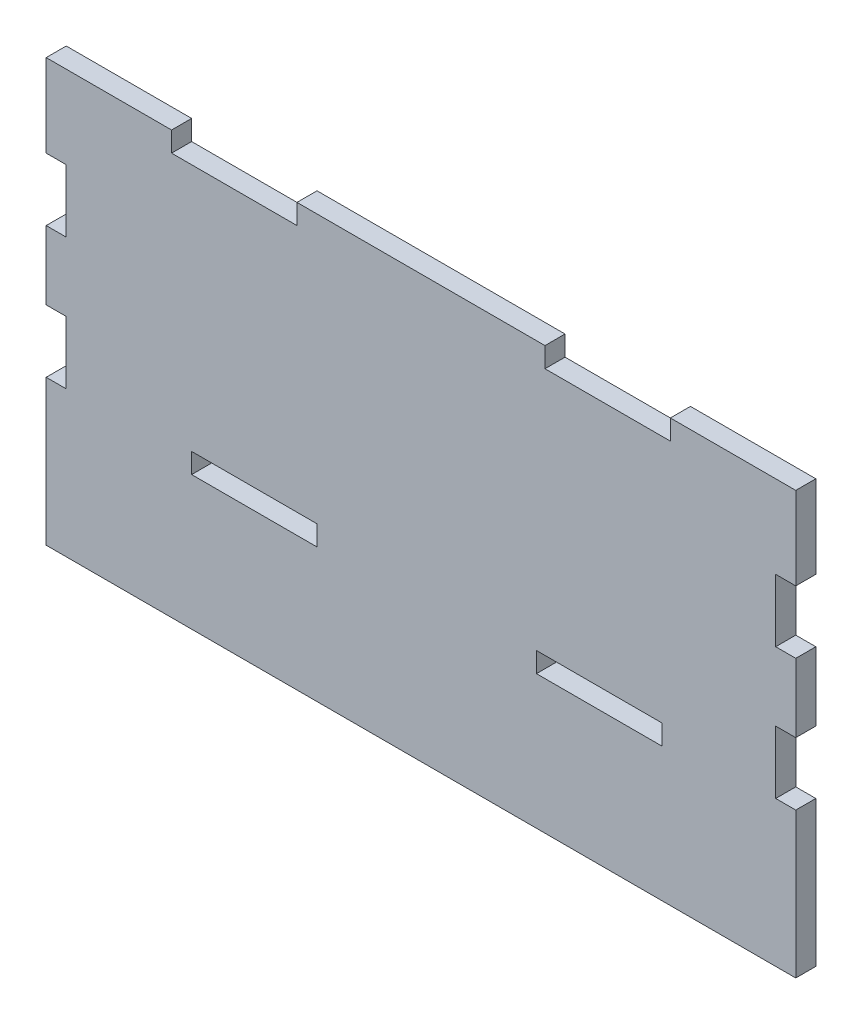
ISO-10303-21;
HEADER;
FILE_DESCRIPTION(('STEP AP214'),'2;1');
FILE_NAME('part.step','',(''),(''),'','','');
FILE_SCHEMA(('AUTOMOTIVE_DESIGN { 1 0 10303 214 1 1 1 1 }'));
ENDSEC;
DATA;
#1=APPLICATION_CONTEXT('core data for automotive mechanical design processes');
#2=APPLICATION_PROTOCOL_DEFINITION('international standard','automotive_design',2000,#1);
#3=PRODUCT_CONTEXT('',#1,'mechanical');
#4=PRODUCT('Part','Part','',(#3));
#5=PRODUCT_RELATED_PRODUCT_CATEGORY('part','',(#4));
#6=PRODUCT_DEFINITION_FORMATION('','',#4);
#7=PRODUCT_DEFINITION_CONTEXT('part definition',#1,'design');
#8=PRODUCT_DEFINITION('design','',#6,#7);
#9=PRODUCT_DEFINITION_SHAPE('','',#8);
#10=(LENGTH_UNIT() NAMED_UNIT(*) SI_UNIT(.MILLI.,.METRE.));
#11=(NAMED_UNIT(*) PLANE_ANGLE_UNIT() SI_UNIT($,.RADIAN.));
#12=(NAMED_UNIT(*) SI_UNIT($,.STERADIAN.) SOLID_ANGLE_UNIT());
#13=UNCERTAINTY_MEASURE_WITH_UNIT(LENGTH_MEASURE(1.E-05),#10,'distance_accuracy_value','');
#14=(GEOMETRIC_REPRESENTATION_CONTEXT(3) GLOBAL_UNCERTAINTY_ASSIGNED_CONTEXT((#13)) GLOBAL_UNIT_ASSIGNED_CONTEXT((#10,
#11,#12)) REPRESENTATION_CONTEXT('',''));
#15=CARTESIAN_POINT('',(0.,0.,0.));
#16=DIRECTION('',(0.,0.,1.));
#17=DIRECTION('',(1.,0.,0.));
#18=AXIS2_PLACEMENT_3D('',#15,#16,#17);
#19=CARTESIAN_POINT('',(0.,90.8,16.));
#20=DIRECTION('',(0.,-1.,0.));
#21=DIRECTION('',(1.,0.,0.));
#22=AXIS2_PLACEMENT_3D('',#19,#20,#21);
#23=PLANE('',#22);
#24=DIRECTION('',(-1.,0.,0.));
#25=VECTOR('',#24,1.);
#26=CARTESIAN_POINT('',(0.,90.8,0.));
#27=LINE('',#26,#25);
#28=CARTESIAN_POINT('',(475.,90.8,0.));
#29=VERTEX_POINT('',#28);
#30=CARTESIAN_POINT('',(375.,90.8,0.));
#31=VERTEX_POINT('',#30);
#32=EDGE_CURVE('E392',#29,#31,#27,.T.);
#33=ORIENTED_EDGE('',*,*,#32,.T.);
#34=DIRECTION('',(0.,0.,-1.));
#35=VECTOR('',#34,1.);
#36=CARTESIAN_POINT('',(375.,90.8,16.));
#37=LINE('',#36,#35);
#38=CARTESIAN_POINT('',(375.,90.8,16.));
#39=VERTEX_POINT('',#38);
#40=EDGE_CURVE('E11',#39,#31,#37,.T.);
#41=ORIENTED_EDGE('',*,*,#40,.F.);
#42=DIRECTION('',(-1.,0.,0.));
#43=VECTOR('',#42,1.);
#44=CARTESIAN_POINT('',(0.,90.8,16.));
#45=LINE('',#44,#43);
#46=CARTESIAN_POINT('',(475.,90.8,16.));
#47=VERTEX_POINT('',#46);
#48=EDGE_CURVE('E282',#47,#39,#45,.T.);
#49=ORIENTED_EDGE('',*,*,#48,.F.);
#50=DIRECTION('',(0.,0.,-1.));
#51=VECTOR('',#50,1.);
#52=CARTESIAN_POINT('',(475.,90.8,16.));
#53=LINE('',#52,#51);
#54=EDGE_CURVE('E54',#47,#29,#53,.T.);
#55=ORIENTED_EDGE('',*,*,#54,.T.);
#56=EDGE_LOOP('',(#33,#41,#49,#55));
#57=FACE_BOUND('',#56,.T.);
#58=ADVANCED_FACE('F35',(#57),#23,.F.);
#59=CARTESIAN_POINT('',(375.,0.,16.));
#60=DIRECTION('',(-1.,0.,0.));
#61=DIRECTION('',(0.,0.,1.));
#62=AXIS2_PLACEMENT_3D('',#59,#60,#61);
#63=PLANE('',#62);
#64=DIRECTION('',(0.,1.,0.));
#65=VECTOR('',#64,1.);
#66=CARTESIAN_POINT('',(375.,0.,0.));
#67=LINE('',#66,#65);
#68=CARTESIAN_POINT('',(375.,106.8,0.));
#69=VERTEX_POINT('',#68);
#70=EDGE_CURVE('E288',#31,#69,#67,.T.);
#71=ORIENTED_EDGE('',*,*,#70,.T.);
#72=DIRECTION('',(0.,0.,-1.));
#73=VECTOR('',#72,1.);
#74=CARTESIAN_POINT('',(375.,106.8,16.));
#75=LINE('',#74,#73);
#76=CARTESIAN_POINT('',(375.,106.8,16.));
#77=VERTEX_POINT('',#76);
#78=EDGE_CURVE('E45',#77,#69,#75,.T.);
#79=ORIENTED_EDGE('',*,*,#78,.F.);
#80=DIRECTION('',(0.,1.,0.));
#81=VECTOR('',#80,1.);
#82=CARTESIAN_POINT('',(375.,0.,16.));
#83=LINE('',#82,#81);
#84=EDGE_CURVE('E276',#39,#77,#83,.T.);
#85=ORIENTED_EDGE('',*,*,#84,.F.);
#86=ORIENTED_EDGE('',*,*,#40,.T.);
#87=EDGE_LOOP('',(#71,#79,#85,#86));
#88=FACE_BOUND('',#87,.T.);
#89=ADVANCED_FACE('F287',(#88),#63,.F.);
#90=CARTESIAN_POINT('',(0.,106.8,16.));
#91=DIRECTION('',(0.,-1.,0.));
#92=DIRECTION('',(0.,0.,-1.));
#93=AXIS2_PLACEMENT_3D('',#90,#91,#92);
#94=PLANE('',#93);
#95=DIRECTION('',(-1.,0.,0.));
#96=VECTOR('',#95,1.);
#97=CARTESIAN_POINT('',(0.,106.8,0.));
#98=LINE('',#97,#96);
#99=CARTESIAN_POINT('',(475.,106.8,0.));
#100=VERTEX_POINT('',#99);
#101=EDGE_CURVE('E395',#100,#69,#98,.T.);
#102=ORIENTED_EDGE('',*,*,#101,.F.);
#103=DIRECTION('',(0.,0.,-1.));
#104=VECTOR('',#103,1.);
#105=CARTESIAN_POINT('',(475.,106.8,16.));
#106=LINE('',#105,#104);
#107=CARTESIAN_POINT('',(475.,106.8,16.));
#108=VERTEX_POINT('',#107);
#109=EDGE_CURVE('E164',#108,#100,#106,.T.);
#110=ORIENTED_EDGE('',*,*,#109,.F.);
#111=DIRECTION('',(-1.,0.,0.));
#112=VECTOR('',#111,1.);
#113=CARTESIAN_POINT('',(0.,106.8,16.));
#114=LINE('',#113,#112);
#115=EDGE_CURVE('E281',#108,#77,#114,.T.);
#116=ORIENTED_EDGE('',*,*,#115,.T.);
#117=ORIENTED_EDGE('',*,*,#78,.T.);
#118=EDGE_LOOP('',(#102,#110,#116,#117));
#119=FACE_BOUND('',#118,.T.);
#120=ADVANCED_FACE('F292',(#119),#94,.T.);
#121=CARTESIAN_POINT('',(581.8,0.,16.));
#122=DIRECTION('',(1.,0.,0.));
#123=DIRECTION('',(0.,0.,-1.));
#124=AXIS2_PLACEMENT_3D('',#121,#122,#123);
#125=PLANE('',#124);
#126=DIRECTION('',(0.,-1.,0.));
#127=VECTOR('',#126,1.);
#128=CARTESIAN_POINT('',(581.8,0.,0.));
#129=LINE('',#128,#127);
#130=CARTESIAN_POINT('',(581.8,320.8,0.));
#131=VERTEX_POINT('',#130);
#132=CARTESIAN_POINT('',(581.8,254.8,0.));
#133=VERTEX_POINT('',#132);
#134=EDGE_CURVE('E310',#131,#133,#129,.T.);
#135=ORIENTED_EDGE('',*,*,#134,.F.);
#136=DIRECTION('',(0.,0.,-1.));
#137=VECTOR('',#136,1.);
#138=CARTESIAN_POINT('',(581.8,320.8,16.));
#139=LINE('',#138,#137);
#140=CARTESIAN_POINT('',(581.8,320.8,16.));
#141=VERTEX_POINT('',#140);
#142=EDGE_CURVE('E402',#141,#131,#139,.T.);
#143=ORIENTED_EDGE('',*,*,#142,.F.);
#144=DIRECTION('',(0.,-1.,0.));
#145=VECTOR('',#144,1.);
#146=CARTESIAN_POINT('',(581.8,0.,16.));
#147=LINE('',#146,#145);
#148=CARTESIAN_POINT('',(581.8,254.8,16.));
#149=VERTEX_POINT('',#148);
#150=EDGE_CURVE('E800',#141,#149,#147,.T.);
#151=ORIENTED_EDGE('',*,*,#150,.T.);
#152=DIRECTION('',(0.,0.,-1.));
#153=VECTOR('',#152,1.);
#154=CARTESIAN_POINT('',(581.8,254.8,16.));
#155=LINE('',#154,#153);
#156=EDGE_CURVE('E404',#149,#133,#155,.T.);
#157=ORIENTED_EDGE('',*,*,#156,.T.);
#158=EDGE_LOOP('',(#135,#143,#151,#157));
#159=FACE_BOUND('',#158,.T.);
#160=ADVANCED_FACE('F610',(#159),#125,.T.);
#161=CARTESIAN_POINT('',(0.,320.8,16.));
#162=DIRECTION('',(0.,1.,0.));
#163=DIRECTION('',(0.,0.,1.));
#164=AXIS2_PLACEMENT_3D('',#161,#162,#163);
#165=PLANE('',#164);
#166=DIRECTION('',(1.,0.,0.));
#167=VECTOR('',#166,1.);
#168=CARTESIAN_POINT('',(0.,320.8,0.));
#169=LINE('',#168,#167);
#170=CARTESIAN_POINT('',(481.8,320.8,0.));
#171=VERTEX_POINT('',#170);
#172=EDGE_CURVE('E313',#171,#131,#169,.T.);
#173=ORIENTED_EDGE('',*,*,#172,.F.);
#174=DIRECTION('',(0.,0.,-1.));
#175=VECTOR('',#174,1.);
#176=CARTESIAN_POINT('',(481.8,320.8,16.));
#177=LINE('',#176,#175);
#178=CARTESIAN_POINT('',(481.8,320.8,16.));
#179=VERTEX_POINT('',#178);
#180=EDGE_CURVE('E464',#179,#171,#177,.T.);
#181=ORIENTED_EDGE('',*,*,#180,.F.);
#182=DIRECTION('',(1.,0.,0.));
#183=VECTOR('',#182,1.);
#184=CARTESIAN_POINT('',(0.,320.8,16.));
#185=LINE('',#184,#183);
#186=EDGE_CURVE('E795',#179,#141,#185,.T.);
#187=ORIENTED_EDGE('',*,*,#186,.T.);
#188=ORIENTED_EDGE('',*,*,#142,.T.);
#189=EDGE_LOOP('',(#173,#181,#187,#188));
#190=FACE_BOUND('',#189,.T.);
#191=ADVANCED_FACE('F598',(#190),#165,.T.);
#192=CARTESIAN_POINT('',(481.8,0.,16.));
#193=DIRECTION('',(1.,0.,0.));
#194=DIRECTION('',(0.,0.,-1.));
#195=AXIS2_PLACEMENT_3D('',#192,#193,#194);
#196=PLANE('',#195);
#197=DIRECTION('',(0.,-1.,0.));
#198=VECTOR('',#197,1.);
#199=CARTESIAN_POINT('',(481.8,0.,0.));
#200=LINE('',#199,#198);
#201=CARTESIAN_POINT('',(481.8,304.8,0.));
#202=VERTEX_POINT('',#201);
#203=EDGE_CURVE('E316',#171,#202,#200,.T.);
#204=ORIENTED_EDGE('',*,*,#203,.T.);
#205=DIRECTION('',(0.,0.,-1.));
#206=VECTOR('',#205,1.);
#207=CARTESIAN_POINT('',(481.8,304.8,16.));
#208=LINE('',#207,#206);
#209=CARTESIAN_POINT('',(481.8,304.8,16.));
#210=VERTEX_POINT('',#209);
#211=EDGE_CURVE('E461',#210,#202,#208,.T.);
#212=ORIENTED_EDGE('',*,*,#211,.F.);
#213=DIRECTION('',(0.,-1.,0.));
#214=VECTOR('',#213,1.);
#215=CARTESIAN_POINT('',(481.8,0.,16.));
#216=LINE('',#215,#214);
#217=EDGE_CURVE('E791',#179,#210,#216,.T.);
#218=ORIENTED_EDGE('',*,*,#217,.F.);
#219=ORIENTED_EDGE('',*,*,#180,.T.);
#220=EDGE_LOOP('',(#204,#212,#218,#219));
#221=FACE_BOUND('',#220,.T.);
#222=ADVANCED_FACE('F605',(#221),#196,.F.);
#223=CARTESIAN_POINT('',(0.,304.8,16.));
#224=DIRECTION('',(0.,-1.,0.));
#225=DIRECTION('',(0.,0.,-1.));
#226=AXIS2_PLACEMENT_3D('',#223,#224,#225);
#227=PLANE('',#226);
#228=DIRECTION('',(-1.,0.,0.));
#229=VECTOR('',#228,1.);
#230=CARTESIAN_POINT('',(0.,304.8,0.));
#231=LINE('',#230,#229);
#232=CARTESIAN_POINT('',(381.8,304.8,0.));
#233=VERTEX_POINT('',#232);
#234=EDGE_CURVE('E320',#202,#233,#231,.T.);
#235=ORIENTED_EDGE('',*,*,#234,.T.);
#236=DIRECTION('',(0.,0.,-1.));
#237=VECTOR('',#236,1.);
#238=CARTESIAN_POINT('',(381.8,304.8,16.));
#239=LINE('',#238,#237);
#240=CARTESIAN_POINT('',(381.8,304.8,16.));
#241=VERTEX_POINT('',#240);
#242=EDGE_CURVE('E459',#241,#233,#239,.T.);
#243=ORIENTED_EDGE('',*,*,#242,.F.);
#244=DIRECTION('',(-1.,0.,0.));
#245=VECTOR('',#244,1.);
#246=CARTESIAN_POINT('',(0.,304.8,16.));
#247=LINE('',#246,#245);
#248=EDGE_CURVE('E794',#210,#241,#247,.T.);
#249=ORIENTED_EDGE('',*,*,#248,.F.);
#250=ORIENTED_EDGE('',*,*,#211,.T.);
#251=EDGE_LOOP('',(#235,#243,#249,#250));
#252=FACE_BOUND('',#251,.T.);
#253=ADVANCED_FACE('F601',(#252),#227,.F.);
#254=CARTESIAN_POINT('',(381.8,0.,16.));
#255=DIRECTION('',(1.,0.,0.));
#256=DIRECTION('',(0.,0.,-1.));
#257=AXIS2_PLACEMENT_3D('',#254,#255,#256);
#258=PLANE('',#257);
#259=DIRECTION('',(0.,-1.,0.));
#260=VECTOR('',#259,1.);
#261=CARTESIAN_POINT('',(381.8,0.,0.));
#262=LINE('',#261,#260);
#263=CARTESIAN_POINT('',(381.8,320.8,0.));
#264=VERTEX_POINT('',#263);
#265=EDGE_CURVE('E323',#264,#233,#262,.T.);
#266=ORIENTED_EDGE('',*,*,#265,.F.);
#267=DIRECTION('',(0.,0.,-1.));
#268=VECTOR('',#267,1.);
#269=CARTESIAN_POINT('',(381.8,320.8,16.));
#270=LINE('',#269,#268);
#271=CARTESIAN_POINT('',(381.8,320.8,16.));
#272=VERTEX_POINT('',#271);
#273=EDGE_CURVE('E457',#272,#264,#270,.T.);
#274=ORIENTED_EDGE('',*,*,#273,.F.);
#275=DIRECTION('',(0.,-1.,0.));
#276=VECTOR('',#275,1.);
#277=CARTESIAN_POINT('',(381.8,0.,16.));
#278=LINE('',#277,#276);
#279=EDGE_CURVE('E806',#272,#241,#278,.T.);
#280=ORIENTED_EDGE('',*,*,#279,.T.);
#281=ORIENTED_EDGE('',*,*,#242,.T.);
#282=EDGE_LOOP('',(#266,#274,#280,#281));
#283=FACE_BOUND('',#282,.T.);
#284=ADVANCED_FACE('F596',(#283),#258,.T.);
#285=CARTESIAN_POINT('',(184.,320.8,0.));
#286=VERTEX_POINT('',#285);
#287=EDGE_CURVE('E317',#286,#264,#169,.T.);
#288=ORIENTED_EDGE('',*,*,#287,.F.);
#289=DIRECTION('',(0.,0.,-1.));
#290=VECTOR('',#289,1.);
#291=CARTESIAN_POINT('',(184.,320.8,16.));
#292=LINE('',#291,#290);
#293=CARTESIAN_POINT('',(184.,320.8,16.));
#294=VERTEX_POINT('',#293);
#295=EDGE_CURVE('E455',#294,#286,#292,.T.);
#296=ORIENTED_EDGE('',*,*,#295,.F.);
#297=EDGE_CURVE('E802',#294,#272,#185,.T.);
#298=ORIENTED_EDGE('',*,*,#297,.T.);
#299=ORIENTED_EDGE('',*,*,#273,.T.);
#300=EDGE_LOOP('',(#288,#296,#298,#299));
#301=FACE_BOUND('',#300,.T.);
#302=ADVANCED_FACE('F592',(#301),#165,.T.);
#303=CARTESIAN_POINT('',(184.000000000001,6.66133814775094E-13,16.));
#304=DIRECTION('',(1.,0.,0.));
#305=DIRECTION('',(0.,1.,0.));
#306=AXIS2_PLACEMENT_3D('',#303,#304,#305);
#307=PLANE('',#306);
#308=DIRECTION('',(0.,-1.,0.));
#309=VECTOR('',#308,1.);
#310=CARTESIAN_POINT('',(184.000000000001,6.66133814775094E-13,0.));
#311=LINE('',#310,#309);
#312=CARTESIAN_POINT('',(184.,304.8,0.));
#313=VERTEX_POINT('',#312);
#314=EDGE_CURVE('E326',#286,#313,#311,.T.);
#315=ORIENTED_EDGE('',*,*,#314,.T.);
#316=DIRECTION('',(0.,0.,-1.));
#317=VECTOR('',#316,1.);
#318=CARTESIAN_POINT('',(184.,304.8,16.));
#319=LINE('',#318,#317);
#320=CARTESIAN_POINT('',(184.,304.8,16.));
#321=VERTEX_POINT('',#320);
#322=EDGE_CURVE('E453',#321,#313,#319,.T.);
#323=ORIENTED_EDGE('',*,*,#322,.F.);
#324=DIRECTION('',(0.,-1.,0.));
#325=VECTOR('',#324,1.);
#326=CARTESIAN_POINT('',(184.000000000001,6.66133814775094E-13,16.));
#327=LINE('',#326,#325);
#328=EDGE_CURVE('E805',#294,#321,#327,.T.);
#329=ORIENTED_EDGE('',*,*,#328,.F.);
#330=ORIENTED_EDGE('',*,*,#295,.T.);
#331=EDGE_LOOP('',(#315,#323,#329,#330));
#332=FACE_BOUND('',#331,.T.);
#333=ADVANCED_FACE('F588',(#332),#307,.F.);
#334=CARTESIAN_POINT('',(0.,304.8,16.));
#335=DIRECTION('',(0.,1.,0.));
#336=DIRECTION('',(0.,0.,1.));
#337=AXIS2_PLACEMENT_3D('',#334,#335,#336);
#338=PLANE('',#337);
#339=DIRECTION('',(1.,0.,0.));
#340=VECTOR('',#339,1.);
#341=CARTESIAN_POINT('',(0.,304.8,0.));
#342=LINE('',#341,#340);
#343=CARTESIAN_POINT('',(84.0000000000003,304.8,0.));
#344=VERTEX_POINT('',#343);
#345=EDGE_CURVE('E329',#344,#313,#342,.T.);
#346=ORIENTED_EDGE('',*,*,#345,.F.);
#347=DIRECTION('',(0.,0.,-1.));
#348=VECTOR('',#347,1.);
#349=CARTESIAN_POINT('',(84.0000000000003,304.8,16.));
#350=LINE('',#349,#348);
#351=CARTESIAN_POINT('',(84.0000000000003,304.8,16.));
#352=VERTEX_POINT('',#351);
#353=EDGE_CURVE('E451',#352,#344,#350,.T.);
#354=ORIENTED_EDGE('',*,*,#353,.F.);
#355=DIRECTION('',(1.,0.,0.));
#356=VECTOR('',#355,1.);
#357=CARTESIAN_POINT('',(0.,304.8,16.));
#358=LINE('',#357,#356);
#359=EDGE_CURVE('E808',#352,#321,#358,.T.);
#360=ORIENTED_EDGE('',*,*,#359,.T.);
#361=ORIENTED_EDGE('',*,*,#322,.T.);
#362=EDGE_LOOP('',(#346,#354,#360,#361));
#363=FACE_BOUND('',#362,.T.);
#364=ADVANCED_FACE('F584',(#363),#338,.T.);
#365=CARTESIAN_POINT('',(84.,0.,16.));
#366=DIRECTION('',(1.,0.,0.));
#367=DIRECTION('',(0.,1.,0.));
#368=AXIS2_PLACEMENT_3D('',#365,#366,#367);
#369=PLANE('',#368);
#370=DIRECTION('',(0.,-1.,0.));
#371=VECTOR('',#370,1.);
#372=CARTESIAN_POINT('',(84.,0.,0.));
#373=LINE('',#372,#371);
#374=CARTESIAN_POINT('',(84.0000000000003,320.8,0.));
#375=VERTEX_POINT('',#374);
#376=EDGE_CURVE('E332',#375,#344,#373,.T.);
#377=ORIENTED_EDGE('',*,*,#376,.F.);
#378=DIRECTION('',(0.,0.,-1.));
#379=VECTOR('',#378,1.);
#380=CARTESIAN_POINT('',(84.0000000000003,320.8,16.));
#381=LINE('',#380,#379);
#382=CARTESIAN_POINT('',(84.0000000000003,320.8,16.));
#383=VERTEX_POINT('',#382);
#384=EDGE_CURVE('E449',#383,#375,#381,.T.);
#385=ORIENTED_EDGE('',*,*,#384,.F.);
#386=DIRECTION('',(0.,-1.,0.));
#387=VECTOR('',#386,1.);
#388=CARTESIAN_POINT('',(84.,0.,16.));
#389=LINE('',#388,#387);
#390=EDGE_CURVE('E817',#383,#352,#389,.T.);
#391=ORIENTED_EDGE('',*,*,#390,.T.);
#392=ORIENTED_EDGE('',*,*,#353,.T.);
#393=EDGE_LOOP('',(#377,#385,#391,#392));
#394=FACE_BOUND('',#393,.T.);
#395=ADVANCED_FACE('F580',(#394),#369,.T.);
#396=CARTESIAN_POINT('',(0.,320.8,16.));
#397=DIRECTION('',(0.,-1.,0.));
#398=DIRECTION('',(0.,0.,-1.));
#399=AXIS2_PLACEMENT_3D('',#396,#397,#398);
#400=PLANE('',#399);
#401=DIRECTION('',(-1.,0.,0.));
#402=VECTOR('',#401,1.);
#403=CARTESIAN_POINT('',(0.,320.8,0.));
#404=LINE('',#403,#402);
#405=CARTESIAN_POINT('',(-16.,320.8,0.));
#406=VERTEX_POINT('',#405);
#407=EDGE_CURVE('E335',#375,#406,#404,.T.);
#408=ORIENTED_EDGE('',*,*,#407,.T.);
#409=DIRECTION('',(0.,0.,-1.));
#410=VECTOR('',#409,1.);
#411=CARTESIAN_POINT('',(-16.,320.8,16.));
#412=LINE('',#411,#410);
#413=CARTESIAN_POINT('',(-16.,320.8,16.));
#414=VERTEX_POINT('',#413);
#415=EDGE_CURVE('E446',#414,#406,#412,.T.);
#416=ORIENTED_EDGE('',*,*,#415,.F.);
#417=DIRECTION('',(-1.,0.,0.));
#418=VECTOR('',#417,1.);
#419=CARTESIAN_POINT('',(0.,320.8,16.));
#420=LINE('',#419,#418);
#421=EDGE_CURVE('E820',#383,#414,#420,.T.);
#422=ORIENTED_EDGE('',*,*,#421,.F.);
#423=ORIENTED_EDGE('',*,*,#384,.T.);
#424=EDGE_LOOP('',(#408,#416,#422,#423));
#425=FACE_BOUND('',#424,.T.);
#426=ADVANCED_FACE('F576',(#425),#400,.F.);
#427=CARTESIAN_POINT('',(-15.9999999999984,0.,16.));
#428=DIRECTION('',(1.,0.,0.));
#429=DIRECTION('',(0.,1.,0.));
#430=AXIS2_PLACEMENT_3D('',#427,#428,#429);
#431=PLANE('',#430);
#432=DIRECTION('',(0.,-1.,0.));
#433=VECTOR('',#432,1.);
#434=CARTESIAN_POINT('',(-15.9999999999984,0.,0.));
#435=LINE('',#434,#433);
#436=CARTESIAN_POINT('',(-15.9999999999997,254.8,0.));
#437=VERTEX_POINT('',#436);
#438=EDGE_CURVE('E338',#406,#437,#435,.T.);
#439=ORIENTED_EDGE('',*,*,#438,.T.);
#440=DIRECTION('',(0.,0.,-1.));
#441=VECTOR('',#440,1.);
#442=CARTESIAN_POINT('',(-15.9999999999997,254.8,16.));
#443=LINE('',#442,#441);
#444=CARTESIAN_POINT('',(-15.9999999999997,254.8,16.));
#445=VERTEX_POINT('',#444);
#446=EDGE_CURVE('E443',#445,#437,#443,.T.);
#447=ORIENTED_EDGE('',*,*,#446,.F.);
#448=DIRECTION('',(0.,-1.,0.));
#449=VECTOR('',#448,1.);
#450=CARTESIAN_POINT('',(-15.9999999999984,0.,16.));
#451=LINE('',#450,#449);
#452=EDGE_CURVE('E823',#414,#445,#451,.T.);
#453=ORIENTED_EDGE('',*,*,#452,.F.);
#454=ORIENTED_EDGE('',*,*,#415,.T.);
#455=EDGE_LOOP('',(#439,#447,#453,#454));
#456=FACE_BOUND('',#455,.T.);
#457=ADVANCED_FACE('F572',(#456),#431,.F.);
#458=CARTESIAN_POINT('',(0.,254.8,16.));
#459=DIRECTION('',(0.,1.,0.));
#460=DIRECTION('',(0.,0.,1.));
#461=AXIS2_PLACEMENT_3D('',#458,#459,#460);
#462=PLANE('',#461);
#463=DIRECTION('',(1.,0.,0.));
#464=VECTOR('',#463,1.);
#465=CARTESIAN_POINT('',(0.,254.8,0.));
#466=LINE('',#465,#464);
#467=CARTESIAN_POINT('',(4.44089209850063E-13,254.8,0.));
#468=VERTEX_POINT('',#467);
#469=EDGE_CURVE('E341',#437,#468,#466,.T.);
#470=ORIENTED_EDGE('',*,*,#469,.T.);
#471=DIRECTION('',(0.,0.,-1.));
#472=VECTOR('',#471,1.);
#473=CARTESIAN_POINT('',(4.44089209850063E-13,254.8,16.));
#474=LINE('',#473,#472);
#475=CARTESIAN_POINT('',(4.44089209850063E-13,254.8,16.));
#476=VERTEX_POINT('',#475);
#477=EDGE_CURVE('E440',#476,#468,#474,.T.);
#478=ORIENTED_EDGE('',*,*,#477,.F.);
#479=DIRECTION('',(1.,0.,0.));
#480=VECTOR('',#479,1.);
#481=CARTESIAN_POINT('',(0.,254.8,16.));
#482=LINE('',#481,#480);
#483=EDGE_CURVE('E826',#445,#476,#482,.T.);
#484=ORIENTED_EDGE('',*,*,#483,.F.);
#485=ORIENTED_EDGE('',*,*,#446,.T.);
#486=EDGE_LOOP('',(#470,#478,#484,#485));
#487=FACE_BOUND('',#486,.T.);
#488=ADVANCED_FACE('F568',(#487),#462,.F.);
#489=CARTESIAN_POINT('',(4.44089209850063E-13,0.,16.));
#490=DIRECTION('',(1.,0.,0.));
#491=DIRECTION('',(0.,0.,-1.));
#492=AXIS2_PLACEMENT_3D('',#489,#490,#491);
#493=PLANE('',#492);
#494=DIRECTION('',(0.,-1.,0.));
#495=VECTOR('',#494,1.);
#496=CARTESIAN_POINT('',(4.44089209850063E-13,0.,0.));
#497=LINE('',#496,#495);
#498=CARTESIAN_POINT('',(4.44089209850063E-13,204.8,0.));
#499=VERTEX_POINT('',#498);
#500=EDGE_CURVE('E344',#468,#499,#497,.T.);
#501=ORIENTED_EDGE('',*,*,#500,.T.);
#502=DIRECTION('',(0.,0.,-1.));
#503=VECTOR('',#502,1.);
#504=CARTESIAN_POINT('',(4.44089209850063E-13,204.8,16.));
#505=LINE('',#504,#503);
#506=CARTESIAN_POINT('',(4.44089209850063E-13,204.8,16.));
#507=VERTEX_POINT('',#506);
#508=EDGE_CURVE('E438',#507,#499,#505,.T.);
#509=ORIENTED_EDGE('',*,*,#508,.F.);
#510=DIRECTION('',(0.,-1.,0.));
#511=VECTOR('',#510,1.);
#512=CARTESIAN_POINT('',(4.44089209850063E-13,0.,16.));
#513=LINE('',#512,#511);
#514=EDGE_CURVE('E829',#476,#507,#513,.T.);
#515=ORIENTED_EDGE('',*,*,#514,.F.);
#516=ORIENTED_EDGE('',*,*,#477,.T.);
#517=EDGE_LOOP('',(#501,#509,#515,#516));
#518=FACE_BOUND('',#517,.T.);
#519=ADVANCED_FACE('F564',(#518),#493,.F.);
#520=CARTESIAN_POINT('',(0.,204.8,16.));
#521=DIRECTION('',(0.,1.,0.));
#522=DIRECTION('',(0.,0.,1.));
#523=AXIS2_PLACEMENT_3D('',#520,#521,#522);
#524=PLANE('',#523);
#525=DIRECTION('',(1.,0.,0.));
#526=VECTOR('',#525,1.);
#527=CARTESIAN_POINT('',(0.,204.8,0.));
#528=LINE('',#527,#526);
#529=CARTESIAN_POINT('',(-15.9999999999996,204.8,0.));
#530=VERTEX_POINT('',#529);
#531=EDGE_CURVE('E347',#530,#499,#528,.T.);
#532=ORIENTED_EDGE('',*,*,#531,.F.);
#533=DIRECTION('',(0.,0.,-1.));
#534=VECTOR('',#533,1.);
#535=CARTESIAN_POINT('',(-15.9999999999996,204.8,16.));
#536=LINE('',#535,#534);
#537=CARTESIAN_POINT('',(-15.9999999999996,204.8,16.));
#538=VERTEX_POINT('',#537);
#539=EDGE_CURVE('E436',#538,#530,#536,.T.);
#540=ORIENTED_EDGE('',*,*,#539,.F.);
#541=DIRECTION('',(1.,0.,0.));
#542=VECTOR('',#541,1.);
#543=CARTESIAN_POINT('',(0.,204.8,16.));
#544=LINE('',#543,#542);
#545=EDGE_CURVE('E831',#538,#507,#544,.T.);
#546=ORIENTED_EDGE('',*,*,#545,.T.);
#547=ORIENTED_EDGE('',*,*,#508,.T.);
#548=EDGE_LOOP('',(#532,#540,#546,#547));
#549=FACE_BOUND('',#548,.T.);
#550=ADVANCED_FACE('F560',(#549),#524,.T.);
#551=CARTESIAN_POINT('',(-16.,0.,16.));
#552=DIRECTION('',(1.,0.,0.));
#553=DIRECTION('',(0.,1.,0.));
#554=AXIS2_PLACEMENT_3D('',#551,#552,#553);
#555=PLANE('',#554);
#556=DIRECTION('',(0.,-1.,0.));
#557=VECTOR('',#556,1.);
#558=CARTESIAN_POINT('',(-16.,0.,0.));
#559=LINE('',#558,#557);
#560=CARTESIAN_POINT('',(-15.9999999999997,150.,0.));
#561=VERTEX_POINT('',#560);
#562=EDGE_CURVE('E350',#530,#561,#559,.T.);
#563=ORIENTED_EDGE('',*,*,#562,.T.);
#564=DIRECTION('',(0.,0.,-1.));
#565=VECTOR('',#564,1.);
#566=CARTESIAN_POINT('',(-15.9999999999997,150.,16.));
#567=LINE('',#566,#565);
#568=CARTESIAN_POINT('',(-15.9999999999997,150.,16.));
#569=VERTEX_POINT('',#568);
#570=EDGE_CURVE('E433',#569,#561,#567,.T.);
#571=ORIENTED_EDGE('',*,*,#570,.F.);
#572=DIRECTION('',(0.,-1.,0.));
#573=VECTOR('',#572,1.);
#574=CARTESIAN_POINT('',(-16.,0.,16.));
#575=LINE('',#574,#573);
#576=EDGE_CURVE('E834',#538,#569,#575,.T.);
#577=ORIENTED_EDGE('',*,*,#576,.F.);
#578=ORIENTED_EDGE('',*,*,#539,.T.);
#579=EDGE_LOOP('',(#563,#571,#577,#578));
#580=FACE_BOUND('',#579,.T.);
#581=ADVANCED_FACE('F556',(#580),#555,.F.);
#582=CARTESIAN_POINT('',(0.,150.,16.));
#583=DIRECTION('',(0.,1.,0.));
#584=DIRECTION('',(0.,0.,1.));
#585=AXIS2_PLACEMENT_3D('',#582,#583,#584);
#586=PLANE('',#585);
#587=DIRECTION('',(1.,0.,0.));
#588=VECTOR('',#587,1.);
#589=CARTESIAN_POINT('',(0.,150.,0.));
#590=LINE('',#589,#588);
#591=CARTESIAN_POINT('',(3.33066907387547E-13,150.,0.));
#592=VERTEX_POINT('',#591);
#593=EDGE_CURVE('E353',#561,#592,#590,.T.);
#594=ORIENTED_EDGE('',*,*,#593,.T.);
#595=DIRECTION('',(0.,0.,-1.));
#596=VECTOR('',#595,1.);
#597=CARTESIAN_POINT('',(3.33066907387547E-13,150.,16.));
#598=LINE('',#597,#596);
#599=CARTESIAN_POINT('',(3.33066907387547E-13,150.,16.));
#600=VERTEX_POINT('',#599);
#601=EDGE_CURVE('E430',#600,#592,#598,.T.);
#602=ORIENTED_EDGE('',*,*,#601,.F.);
#603=DIRECTION('',(1.,0.,0.));
#604=VECTOR('',#603,1.);
#605=CARTESIAN_POINT('',(0.,150.,16.));
#606=LINE('',#605,#604);
#607=EDGE_CURVE('E837',#569,#600,#606,.T.);
#608=ORIENTED_EDGE('',*,*,#607,.F.);
#609=ORIENTED_EDGE('',*,*,#570,.T.);
#610=EDGE_LOOP('',(#594,#602,#608,#609));
#611=FACE_BOUND('',#610,.T.);
#612=ADVANCED_FACE('F552',(#611),#586,.F.);
#613=CARTESIAN_POINT('',(3.33066907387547E-13,0.,16.));
#614=DIRECTION('',(1.,0.,0.));
#615=DIRECTION('',(0.,0.,-1.));
#616=AXIS2_PLACEMENT_3D('',#613,#614,#615);
#617=PLANE('',#616);
#618=DIRECTION('',(0.,-1.,0.));
#619=VECTOR('',#618,1.);
#620=CARTESIAN_POINT('',(3.33066907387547E-13,0.,0.));
#621=LINE('',#620,#619);
#622=CARTESIAN_POINT('',(3.33066907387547E-13,99.9999999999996,0.));
#623=VERTEX_POINT('',#622);
#624=EDGE_CURVE('E356',#592,#623,#621,.T.);
#625=ORIENTED_EDGE('',*,*,#624,.T.);
#626=DIRECTION('',(0.,0.,-1.));
#627=VECTOR('',#626,1.);
#628=CARTESIAN_POINT('',(3.33066907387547E-13,99.9999999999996,16.));
#629=LINE('',#628,#627);
#630=CARTESIAN_POINT('',(3.33066907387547E-13,99.9999999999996,16.));
#631=VERTEX_POINT('',#630);
#632=EDGE_CURVE('E427',#631,#623,#629,.T.);
#633=ORIENTED_EDGE('',*,*,#632,.F.);
#634=DIRECTION('',(0.,-1.,0.));
#635=VECTOR('',#634,1.);
#636=CARTESIAN_POINT('',(3.33066907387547E-13,0.,16.));
#637=LINE('',#636,#635);
#638=EDGE_CURVE('E840',#600,#631,#637,.T.);
#639=ORIENTED_EDGE('',*,*,#638,.F.);
#640=ORIENTED_EDGE('',*,*,#601,.T.);
#641=EDGE_LOOP('',(#625,#633,#639,#640));
#642=FACE_BOUND('',#641,.T.);
#643=ADVANCED_FACE('F548',(#642),#617,.F.);
#644=CARTESIAN_POINT('',(0.,99.9999999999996,16.));
#645=DIRECTION('',(0.,-1.,0.));
#646=DIRECTION('',(0.,0.,-1.));
#647=AXIS2_PLACEMENT_3D('',#644,#645,#646);
#648=PLANE('',#647);
#649=DIRECTION('',(-1.,0.,0.));
#650=VECTOR('',#649,1.);
#651=CARTESIAN_POINT('',(0.,99.9999999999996,0.));
#652=LINE('',#651,#650);
#653=CARTESIAN_POINT('',(-15.9999999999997,99.9999999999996,0.));
#654=VERTEX_POINT('',#653);
#655=EDGE_CURVE('E359',#623,#654,#652,.T.);
#656=ORIENTED_EDGE('',*,*,#655,.T.);
#657=DIRECTION('',(0.,0.,-1.));
#658=VECTOR('',#657,1.);
#659=CARTESIAN_POINT('',(-15.9999999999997,99.9999999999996,16.));
#660=LINE('',#659,#658);
#661=CARTESIAN_POINT('',(-15.9999999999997,99.9999999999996,16.));
#662=VERTEX_POINT('',#661);
#663=EDGE_CURVE('E424',#662,#654,#660,.T.);
#664=ORIENTED_EDGE('',*,*,#663,.F.);
#665=DIRECTION('',(-1.,0.,0.));
#666=VECTOR('',#665,1.);
#667=CARTESIAN_POINT('',(0.,99.9999999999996,16.));
#668=LINE('',#667,#666);
#669=EDGE_CURVE('E843',#631,#662,#668,.T.);
#670=ORIENTED_EDGE('',*,*,#669,.F.);
#671=ORIENTED_EDGE('',*,*,#632,.T.);
#672=EDGE_LOOP('',(#656,#664,#670,#671));
#673=FACE_BOUND('',#672,.T.);
#674=ADVANCED_FACE('F544',(#673),#648,.F.);
#675=CARTESIAN_POINT('',(-16.,0.,16.));
#676=DIRECTION('',(1.,0.,0.));
#677=DIRECTION('',(0.,1.,0.));
#678=AXIS2_PLACEMENT_3D('',#675,#676,#677);
#679=PLANE('',#678);
#680=DIRECTION('',(0.,-1.,0.));
#681=VECTOR('',#680,1.);
#682=CARTESIAN_POINT('',(-16.,0.,0.));
#683=LINE('',#682,#681);
#684=CARTESIAN_POINT('',(-16.,-16.,0.));
#685=VERTEX_POINT('',#684);
#686=EDGE_CURVE('E362',#654,#685,#683,.T.);
#687=ORIENTED_EDGE('',*,*,#686,.T.);
#688=DIRECTION('',(0.,0.,-1.));
#689=VECTOR('',#688,1.);
#690=CARTESIAN_POINT('',(-16.,-16.,16.));
#691=LINE('',#690,#689);
#692=CARTESIAN_POINT('',(-16.,-16.,16.));
#693=VERTEX_POINT('',#692);
#694=EDGE_CURVE('E422',#693,#685,#691,.T.);
#695=ORIENTED_EDGE('',*,*,#694,.F.);
#696=DIRECTION('',(0.,-1.,0.));
#697=VECTOR('',#696,1.);
#698=CARTESIAN_POINT('',(-16.,0.,16.));
#699=LINE('',#698,#697);
#700=EDGE_CURVE('E846',#662,#693,#699,.T.);
#701=ORIENTED_EDGE('',*,*,#700,.F.);
#702=ORIENTED_EDGE('',*,*,#663,.T.);
#703=EDGE_LOOP('',(#687,#695,#701,#702));
#704=FACE_BOUND('',#703,.T.);
#705=ADVANCED_FACE('F540',(#704),#679,.F.);
#706=CARTESIAN_POINT('',(0.,-16.,16.));
#707=DIRECTION('',(0.,-1.,0.));
#708=DIRECTION('',(1.,0.,0.));
#709=AXIS2_PLACEMENT_3D('',#706,#707,#708);
#710=PLANE('',#709);
#711=DIRECTION('',(-1.,0.,0.));
#712=VECTOR('',#711,1.);
#713=CARTESIAN_POINT('',(0.,-16.,0.));
#714=LINE('',#713,#712);
#715=CARTESIAN_POINT('',(581.8,-16.,0.));
#716=VERTEX_POINT('',#715);
#717=EDGE_CURVE('E365',#716,#685,#714,.T.);
#718=ORIENTED_EDGE('',*,*,#717,.F.);
#719=DIRECTION('',(0.,0.,-1.));
#720=VECTOR('',#719,1.);
#721=CARTESIAN_POINT('',(581.8,-16.,16.));
#722=LINE('',#721,#720);
#723=CARTESIAN_POINT('',(581.8,-16.,16.));
#724=VERTEX_POINT('',#723);
#725=EDGE_CURVE('E420',#724,#716,#722,.T.);
#726=ORIENTED_EDGE('',*,*,#725,.F.);
#727=DIRECTION('',(-1.,0.,0.));
#728=VECTOR('',#727,1.);
#729=CARTESIAN_POINT('',(0.,-16.,16.));
#730=LINE('',#729,#728);
#731=EDGE_CURVE('E848',#724,#693,#730,.T.);
#732=ORIENTED_EDGE('',*,*,#731,.T.);
#733=ORIENTED_EDGE('',*,*,#694,.T.);
#734=EDGE_LOOP('',(#718,#726,#732,#733));
#735=FACE_BOUND('',#734,.T.);
#736=ADVANCED_FACE('F536',(#735),#710,.T.);
#737=CARTESIAN_POINT('',(581.8,0.,16.));
#738=DIRECTION('',(1.,0.,0.));
#739=DIRECTION('',(0.,0.,-1.));
#740=AXIS2_PLACEMENT_3D('',#737,#738,#739);
#741=PLANE('',#740);
#742=DIRECTION('',(0.,-1.,0.));
#743=VECTOR('',#742,1.);
#744=CARTESIAN_POINT('',(581.8,0.,0.));
#745=LINE('',#744,#743);
#746=CARTESIAN_POINT('',(581.8,99.9999999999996,0.));
#747=VERTEX_POINT('',#746);
#748=EDGE_CURVE('E368',#747,#716,#745,.T.);
#749=ORIENTED_EDGE('',*,*,#748,.F.);
#750=DIRECTION('',(0.,0.,-1.));
#751=VECTOR('',#750,1.);
#752=CARTESIAN_POINT('',(581.8,99.9999999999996,16.));
#753=LINE('',#752,#751);
#754=CARTESIAN_POINT('',(581.8,99.9999999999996,16.));
#755=VERTEX_POINT('',#754);
#756=EDGE_CURVE('E418',#755,#747,#753,.T.);
#757=ORIENTED_EDGE('',*,*,#756,.F.);
#758=DIRECTION('',(0.,-1.,0.));
#759=VECTOR('',#758,1.);
#760=CARTESIAN_POINT('',(581.8,0.,16.));
#761=LINE('',#760,#759);
#762=EDGE_CURVE('E851',#755,#724,#761,.T.);
#763=ORIENTED_EDGE('',*,*,#762,.T.);
#764=ORIENTED_EDGE('',*,*,#725,.T.);
#765=EDGE_LOOP('',(#749,#757,#763,#764));
#766=FACE_BOUND('',#765,.T.);
#767=ADVANCED_FACE('F532',(#766),#741,.T.);
#768=CARTESIAN_POINT('',(0.,99.9999999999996,16.));
#769=DIRECTION('',(0.,1.,0.));
#770=DIRECTION('',(0.,0.,1.));
#771=AXIS2_PLACEMENT_3D('',#768,#769,#770);
#772=PLANE('',#771);
#773=DIRECTION('',(1.,0.,0.));
#774=VECTOR('',#773,1.);
#775=CARTESIAN_POINT('',(0.,99.9999999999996,0.));
#776=LINE('',#775,#774);
#777=CARTESIAN_POINT('',(565.800000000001,99.9999999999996,0.));
#778=VERTEX_POINT('',#777);
#779=EDGE_CURVE('E371',#778,#747,#776,.T.);
#780=ORIENTED_EDGE('',*,*,#779,.F.);
#781=DIRECTION('',(0.,0.,-1.));
#782=VECTOR('',#781,1.);
#783=CARTESIAN_POINT('',(565.800000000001,99.9999999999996,16.));
#784=LINE('',#783,#782);
#785=CARTESIAN_POINT('',(565.800000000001,99.9999999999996,16.));
#786=VERTEX_POINT('',#785);
#787=EDGE_CURVE('E416',#786,#778,#784,.T.);
#788=ORIENTED_EDGE('',*,*,#787,.F.);
#789=DIRECTION('',(1.,0.,0.));
#790=VECTOR('',#789,1.);
#791=CARTESIAN_POINT('',(0.,99.9999999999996,16.));
#792=LINE('',#791,#790);
#793=EDGE_CURVE('E854',#786,#755,#792,.T.);
#794=ORIENTED_EDGE('',*,*,#793,.T.);
#795=ORIENTED_EDGE('',*,*,#756,.T.);
#796=EDGE_LOOP('',(#780,#788,#794,#795));
#797=FACE_BOUND('',#796,.T.);
#798=ADVANCED_FACE('F528',(#797),#772,.T.);
#799=CARTESIAN_POINT('',(565.800000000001,0.,16.));
#800=DIRECTION('',(1.,0.,0.));
#801=DIRECTION('',(0.,0.,-1.));
#802=AXIS2_PLACEMENT_3D('',#799,#800,#801);
#803=PLANE('',#802);
#804=DIRECTION('',(0.,-1.,0.));
#805=VECTOR('',#804,1.);
#806=CARTESIAN_POINT('',(565.800000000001,0.,0.));
#807=LINE('',#806,#805);
#808=CARTESIAN_POINT('',(565.800000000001,150.,0.));
#809=VERTEX_POINT('',#808);
#810=EDGE_CURVE('E374',#809,#778,#807,.T.);
#811=ORIENTED_EDGE('',*,*,#810,.F.);
#812=DIRECTION('',(0.,0.,-1.));
#813=VECTOR('',#812,1.);
#814=CARTESIAN_POINT('',(565.800000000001,150.,16.));
#815=LINE('',#814,#813);
#816=CARTESIAN_POINT('',(565.800000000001,150.,16.));
#817=VERTEX_POINT('',#816);
#818=EDGE_CURVE('E414',#817,#809,#815,.T.);
#819=ORIENTED_EDGE('',*,*,#818,.F.);
#820=DIRECTION('',(0.,-1.,0.));
#821=VECTOR('',#820,1.);
#822=CARTESIAN_POINT('',(565.800000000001,0.,16.));
#823=LINE('',#822,#821);
#824=EDGE_CURVE('E857',#817,#786,#823,.T.);
#825=ORIENTED_EDGE('',*,*,#824,.T.);
#826=ORIENTED_EDGE('',*,*,#787,.T.);
#827=EDGE_LOOP('',(#811,#819,#825,#826));
#828=FACE_BOUND('',#827,.T.);
#829=ADVANCED_FACE('F524',(#828),#803,.T.);
#830=CARTESIAN_POINT('',(0.,150.,16.));
#831=DIRECTION('',(0.,-1.,0.));
#832=DIRECTION('',(0.,0.,-1.));
#833=AXIS2_PLACEMENT_3D('',#830,#831,#832);
#834=PLANE('',#833);
#835=DIRECTION('',(-1.,0.,0.));
#836=VECTOR('',#835,1.);
#837=CARTESIAN_POINT('',(0.,150.,0.));
#838=LINE('',#837,#836);
#839=CARTESIAN_POINT('',(581.8,150.,0.));
#840=VERTEX_POINT('',#839);
#841=EDGE_CURVE('E377',#840,#809,#838,.T.);
#842=ORIENTED_EDGE('',*,*,#841,.F.);
#843=DIRECTION('',(0.,0.,-1.));
#844=VECTOR('',#843,1.);
#845=CARTESIAN_POINT('',(581.8,150.,16.));
#846=LINE('',#845,#844);
#847=CARTESIAN_POINT('',(581.8,150.,16.));
#848=VERTEX_POINT('',#847);
#849=EDGE_CURVE('E412',#848,#840,#846,.T.);
#850=ORIENTED_EDGE('',*,*,#849,.F.);
#851=DIRECTION('',(-1.,0.,0.));
#852=VECTOR('',#851,1.);
#853=CARTESIAN_POINT('',(0.,150.,16.));
#854=LINE('',#853,#852);
#855=EDGE_CURVE('E860',#848,#817,#854,.T.);
#856=ORIENTED_EDGE('',*,*,#855,.T.);
#857=ORIENTED_EDGE('',*,*,#818,.T.);
#858=EDGE_LOOP('',(#842,#850,#856,#857));
#859=FACE_BOUND('',#858,.T.);
#860=ADVANCED_FACE('F520',(#859),#834,.T.);
#861=CARTESIAN_POINT('',(581.8,0.,16.));
#862=DIRECTION('',(1.,0.,0.));
#863=DIRECTION('',(0.,0.,-1.));
#864=AXIS2_PLACEMENT_3D('',#861,#862,#863);
#865=PLANE('',#864);
#866=DIRECTION('',(0.,-1.,0.));
#867=VECTOR('',#866,1.);
#868=CARTESIAN_POINT('',(581.8,0.,0.));
#869=LINE('',#868,#867);
#870=CARTESIAN_POINT('',(581.8,204.8,0.));
#871=VERTEX_POINT('',#870);
#872=EDGE_CURVE('E380',#871,#840,#869,.T.);
#873=ORIENTED_EDGE('',*,*,#872,.F.);
#874=DIRECTION('',(0.,0.,-1.));
#875=VECTOR('',#874,1.);
#876=CARTESIAN_POINT('',(581.8,204.8,16.));
#877=LINE('',#876,#875);
#878=CARTESIAN_POINT('',(581.8,204.8,16.));
#879=VERTEX_POINT('',#878);
#880=EDGE_CURVE('E410',#879,#871,#877,.T.);
#881=ORIENTED_EDGE('',*,*,#880,.F.);
#882=DIRECTION('',(0.,-1.,0.));
#883=VECTOR('',#882,1.);
#884=CARTESIAN_POINT('',(581.8,0.,16.));
#885=LINE('',#884,#883);
#886=EDGE_CURVE('E863',#879,#848,#885,.T.);
#887=ORIENTED_EDGE('',*,*,#886,.T.);
#888=ORIENTED_EDGE('',*,*,#849,.T.);
#889=EDGE_LOOP('',(#873,#881,#887,#888));
#890=FACE_BOUND('',#889,.T.);
#891=ADVANCED_FACE('F516',(#890),#865,.T.);
#892=CARTESIAN_POINT('',(0.,204.8,16.));
#893=DIRECTION('',(0.,-1.,0.));
#894=DIRECTION('',(0.,0.,-1.));
#895=AXIS2_PLACEMENT_3D('',#892,#893,#894);
#896=PLANE('',#895);
#897=DIRECTION('',(-1.,0.,0.));
#898=VECTOR('',#897,1.);
#899=CARTESIAN_POINT('',(0.,204.8,0.));
#900=LINE('',#899,#898);
#901=CARTESIAN_POINT('',(565.800000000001,204.8,0.));
#902=VERTEX_POINT('',#901);
#903=EDGE_CURVE('E383',#871,#902,#900,.T.);
#904=ORIENTED_EDGE('',*,*,#903,.T.);
#905=DIRECTION('',(0.,0.,-1.));
#906=VECTOR('',#905,1.);
#907=CARTESIAN_POINT('',(565.800000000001,204.8,16.));
#908=LINE('',#907,#906);
#909=CARTESIAN_POINT('',(565.800000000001,204.8,16.));
#910=VERTEX_POINT('',#909);
#911=EDGE_CURVE('E408',#910,#902,#908,.T.);
#912=ORIENTED_EDGE('',*,*,#911,.F.);
#913=DIRECTION('',(-1.,0.,0.));
#914=VECTOR('',#913,1.);
#915=CARTESIAN_POINT('',(0.,204.8,16.));
#916=LINE('',#915,#914);
#917=EDGE_CURVE('E866',#879,#910,#916,.T.);
#918=ORIENTED_EDGE('',*,*,#917,.F.);
#919=ORIENTED_EDGE('',*,*,#880,.T.);
#920=EDGE_LOOP('',(#904,#912,#918,#919));
#921=FACE_BOUND('',#920,.T.);
#922=ADVANCED_FACE('F512',(#921),#896,.F.);
#923=CARTESIAN_POINT('',(565.800000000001,0.,16.));
#924=DIRECTION('',(1.,0.,0.));
#925=DIRECTION('',(0.,0.,-1.));
#926=AXIS2_PLACEMENT_3D('',#923,#924,#925);
#927=PLANE('',#926);
#928=DIRECTION('',(0.,-1.,0.));
#929=VECTOR('',#928,1.);
#930=CARTESIAN_POINT('',(565.800000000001,0.,0.));
#931=LINE('',#930,#929);
#932=CARTESIAN_POINT('',(565.800000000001,254.8,0.));
#933=VERTEX_POINT('',#932);
#934=EDGE_CURVE('E386',#933,#902,#931,.T.);
#935=ORIENTED_EDGE('',*,*,#934,.F.);
#936=DIRECTION('',(0.,0.,-1.));
#937=VECTOR('',#936,1.);
#938=CARTESIAN_POINT('',(565.800000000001,254.8,16.));
#939=LINE('',#938,#937);
#940=CARTESIAN_POINT('',(565.800000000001,254.8,16.));
#941=VERTEX_POINT('',#940);
#942=EDGE_CURVE('E406',#941,#933,#939,.T.);
#943=ORIENTED_EDGE('',*,*,#942,.F.);
#944=DIRECTION('',(0.,-1.,0.));
#945=VECTOR('',#944,1.);
#946=CARTESIAN_POINT('',(565.800000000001,0.,16.));
#947=LINE('',#946,#945);
#948=EDGE_CURVE('E868',#941,#910,#947,.T.);
#949=ORIENTED_EDGE('',*,*,#948,.T.);
#950=ORIENTED_EDGE('',*,*,#911,.T.);
#951=EDGE_LOOP('',(#935,#943,#949,#950));
#952=FACE_BOUND('',#951,.T.);
#953=ADVANCED_FACE('F509',(#952),#927,.T.);
#954=CARTESIAN_POINT('',(0.,90.7999999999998,16.));
#955=DIRECTION('',(0.,1.,0.));
#956=DIRECTION('',(0.,0.,1.));
#957=AXIS2_PLACEMENT_3D('',#954,#955,#956);
#958=PLANE('',#957);
#959=DIRECTION('',(1.,0.,0.));
#960=VECTOR('',#959,1.);
#961=CARTESIAN_POINT('',(0.,90.7999999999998,0.));
#962=LINE('',#961,#960);
#963=CARTESIAN_POINT('',(100.,90.7999999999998,0.));
#964=VERTEX_POINT('',#963);
#965=CARTESIAN_POINT('',(200.,90.7999999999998,0.));
#966=VERTEX_POINT('',#965);
#967=EDGE_CURVE('E299',#964,#966,#962,.T.);
#968=ORIENTED_EDGE('',*,*,#967,.F.);
#969=DIRECTION('',(0.,0.,-1.));
#970=VECTOR('',#969,1.);
#971=CARTESIAN_POINT('',(100.,90.7999999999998,16.));
#972=LINE('',#971,#970);
#973=CARTESIAN_POINT('',(100.,90.7999999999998,16.));
#974=VERTEX_POINT('',#973);
#975=EDGE_CURVE('E39',#974,#964,#972,.T.);
#976=ORIENTED_EDGE('',*,*,#975,.F.);
#977=DIRECTION('',(1.,0.,0.));
#978=VECTOR('',#977,1.);
#979=CARTESIAN_POINT('',(0.,90.7999999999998,16.));
#980=LINE('',#979,#978);
#981=CARTESIAN_POINT('',(200.,90.7999999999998,16.));
#982=VERTEX_POINT('',#981);
#983=EDGE_CURVE('E400',#974,#982,#980,.T.);
#984=ORIENTED_EDGE('',*,*,#983,.T.);
#985=DIRECTION('',(0.,0.,-1.));
#986=VECTOR('',#985,1.);
#987=CARTESIAN_POINT('',(200.,90.7999999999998,16.));
#988=LINE('',#987,#986);
#989=EDGE_CURVE('E295',#982,#966,#988,.T.);
#990=ORIENTED_EDGE('',*,*,#989,.T.);
#991=EDGE_LOOP('',(#968,#976,#984,#990));
#992=FACE_BOUND('',#991,.T.);
#993=ADVANCED_FACE('F37',(#992),#958,.T.);
#994=CARTESIAN_POINT('',(100.,0.,16.));
#995=DIRECTION('',(-1.,0.,0.));
#996=DIRECTION('',(0.,0.,1.));
#997=AXIS2_PLACEMENT_3D('',#994,#995,#996);
#998=PLANE('',#997);
#999=DIRECTION('',(0.,1.,0.));
#1000=VECTOR('',#999,1.);
#1001=CARTESIAN_POINT('',(100.,0.,0.));
#1002=LINE('',#1001,#1000);
#1003=CARTESIAN_POINT('',(100.,106.8,0.));
#1004=VERTEX_POINT('',#1003);
#1005=EDGE_CURVE('E302',#964,#1004,#1002,.T.);
#1006=ORIENTED_EDGE('',*,*,#1005,.T.);
#1007=DIRECTION('',(0.,0.,-1.));
#1008=VECTOR('',#1007,1.);
#1009=CARTESIAN_POINT('',(100.,106.8,16.));
#1010=LINE('',#1009,#1008);
#1011=CARTESIAN_POINT('',(100.,106.8,16.));
#1012=VERTEX_POINT('',#1011);
#1013=EDGE_CURVE('E469',#1012,#1004,#1010,.T.);
#1014=ORIENTED_EDGE('',*,*,#1013,.F.);
#1015=DIRECTION('',(0.,1.,0.));
#1016=VECTOR('',#1015,1.);
#1017=CARTESIAN_POINT('',(100.,0.,16.));
#1018=LINE('',#1017,#1016);
#1019=EDGE_CURVE('E478',#974,#1012,#1018,.T.);
#1020=ORIENTED_EDGE('',*,*,#1019,.F.);
#1021=ORIENTED_EDGE('',*,*,#975,.T.);
#1022=EDGE_LOOP('',(#1006,#1014,#1020,#1021));
#1023=FACE_BOUND('',#1022,.T.);
#1024=ADVANCED_FACE('F477',(#1023),#998,.F.);
#1025=CARTESIAN_POINT('',(0.,106.8,16.));
#1026=DIRECTION('',(0.,1.,0.));
#1027=DIRECTION('',(-1.,0.,0.));
#1028=AXIS2_PLACEMENT_3D('',#1025,#1026,#1027);
#1029=PLANE('',#1028);
#1030=DIRECTION('',(1.,0.,0.));
#1031=VECTOR('',#1030,1.);
#1032=CARTESIAN_POINT('',(0.,106.8,0.));
#1033=LINE('',#1032,#1031);
#1034=CARTESIAN_POINT('',(200.,106.8,0.));
#1035=VERTEX_POINT('',#1034);
#1036=EDGE_CURVE('E304',#1004,#1035,#1033,.T.);
#1037=ORIENTED_EDGE('',*,*,#1036,.T.);
#1038=DIRECTION('',(0.,0.,-1.));
#1039=VECTOR('',#1038,1.);
#1040=CARTESIAN_POINT('',(200.,106.8,16.));
#1041=LINE('',#1040,#1039);
#1042=CARTESIAN_POINT('',(200.,106.8,16.));
#1043=VERTEX_POINT('',#1042);
#1044=EDGE_CURVE('E468',#1043,#1035,#1041,.T.);
#1045=ORIENTED_EDGE('',*,*,#1044,.F.);
#1046=DIRECTION('',(1.,0.,0.));
#1047=VECTOR('',#1046,1.);
#1048=CARTESIAN_POINT('',(0.,106.8,16.));
#1049=LINE('',#1048,#1047);
#1050=EDGE_CURVE('E918',#1012,#1043,#1049,.T.);
#1051=ORIENTED_EDGE('',*,*,#1050,.F.);
#1052=ORIENTED_EDGE('',*,*,#1013,.T.);
#1053=EDGE_LOOP('',(#1037,#1045,#1051,#1052));
#1054=FACE_BOUND('',#1053,.T.);
#1055=ADVANCED_FACE('F490',(#1054),#1029,.F.);
#1056=CARTESIAN_POINT('',(0.,254.8,16.));
#1057=DIRECTION('',(0.,-1.,0.));
#1058=DIRECTION('',(0.,0.,-1.));
#1059=AXIS2_PLACEMENT_3D('',#1056,#1057,#1058);
#1060=PLANE('',#1059);
#1061=DIRECTION('',(-1.,0.,0.));
#1062=VECTOR('',#1061,1.);
#1063=CARTESIAN_POINT('',(0.,254.8,0.));
#1064=LINE('',#1063,#1062);
#1065=EDGE_CURVE('E389',#133,#933,#1064,.T.);
#1066=ORIENTED_EDGE('',*,*,#1065,.F.);
#1067=ORIENTED_EDGE('',*,*,#156,.F.);
#1068=DIRECTION('',(-1.,0.,0.));
#1069=VECTOR('',#1068,1.);
#1070=CARTESIAN_POINT('',(0.,254.8,16.));
#1071=LINE('',#1070,#1069);
#1072=EDGE_CURVE('E871',#149,#941,#1071,.T.);
#1073=ORIENTED_EDGE('',*,*,#1072,.T.);
#1074=ORIENTED_EDGE('',*,*,#942,.T.);
#1075=EDGE_LOOP('',(#1066,#1067,#1073,#1074));
#1076=FACE_BOUND('',#1075,.T.);
#1077=ADVANCED_FACE('F492',(#1076),#1060,.T.);
#1078=CARTESIAN_POINT('',(200.,0.,16.));
#1079=DIRECTION('',(-1.,0.,0.));
#1080=DIRECTION('',(0.,0.,1.));
#1081=AXIS2_PLACEMENT_3D('',#1078,#1079,#1080);
#1082=PLANE('',#1081);
#1083=DIRECTION('',(0.,1.,0.));
#1084=VECTOR('',#1083,1.);
#1085=CARTESIAN_POINT('',(200.,0.,0.));
#1086=LINE('',#1085,#1084);
#1087=EDGE_CURVE('E307',#966,#1035,#1086,.T.);
#1088=ORIENTED_EDGE('',*,*,#1087,.F.);
#1089=ORIENTED_EDGE('',*,*,#989,.F.);
#1090=DIRECTION('',(0.,1.,0.));
#1091=VECTOR('',#1090,1.);
#1092=CARTESIAN_POINT('',(200.,0.,16.));
#1093=LINE('',#1092,#1091);
#1094=EDGE_CURVE('E488',#982,#1043,#1093,.T.);
#1095=ORIENTED_EDGE('',*,*,#1094,.T.);
#1096=ORIENTED_EDGE('',*,*,#1044,.T.);
#1097=EDGE_LOOP('',(#1088,#1089,#1095,#1096));
#1098=FACE_BOUND('',#1097,.T.);
#1099=ADVANCED_FACE('F487',(#1098),#1082,.T.);
#1100=CARTESIAN_POINT('',(475.,0.,16.));
#1101=DIRECTION('',(-1.,0.,0.));
#1102=DIRECTION('',(0.,0.,1.));
#1103=AXIS2_PLACEMENT_3D('',#1100,#1101,#1102);
#1104=PLANE('',#1103);
#1105=DIRECTION('',(0.,1.,0.));
#1106=VECTOR('',#1105,1.);
#1107=CARTESIAN_POINT('',(475.,0.,0.));
#1108=LINE('',#1107,#1106);
#1109=EDGE_CURVE('E397',#29,#100,#1108,.T.);
#1110=ORIENTED_EDGE('',*,*,#1109,.F.);
#1111=ORIENTED_EDGE('',*,*,#54,.F.);
#1112=DIRECTION('',(0.,1.,0.));
#1113=VECTOR('',#1112,1.);
#1114=CARTESIAN_POINT('',(475.,0.,16.));
#1115=LINE('',#1114,#1113);
#1116=EDGE_CURVE('E293',#47,#108,#1115,.T.);
#1117=ORIENTED_EDGE('',*,*,#1116,.T.);
#1118=ORIENTED_EDGE('',*,*,#109,.T.);
#1119=EDGE_LOOP('',(#1110,#1111,#1117,#1118));
#1120=FACE_BOUND('',#1119,.T.);
#1121=ADVANCED_FACE('F614',(#1120),#1104,.T.);
#1122=CARTESIAN_POINT('',(0.,0.,16.));
#1123=DIRECTION('',(0.,0.,1.));
#1124=DIRECTION('',(1.,0.,0.));
#1125=AXIS2_PLACEMENT_3D('',#1122,#1123,#1124);
#1126=PLANE('',#1125);
#1127=ORIENTED_EDGE('',*,*,#983,.F.);
#1128=ORIENTED_EDGE('',*,*,#1019,.T.);
#1129=ORIENTED_EDGE('',*,*,#1050,.T.);
#1130=ORIENTED_EDGE('',*,*,#1094,.F.);
#1131=EDGE_LOOP('',(#1127,#1128,#1129,#1130));
#1132=FACE_BOUND('',#1131,.T.);
#1133=ORIENTED_EDGE('',*,*,#150,.F.);
#1134=ORIENTED_EDGE('',*,*,#186,.F.);
#1135=ORIENTED_EDGE('',*,*,#217,.T.);
#1136=ORIENTED_EDGE('',*,*,#248,.T.);
#1137=ORIENTED_EDGE('',*,*,#279,.F.);
#1138=ORIENTED_EDGE('',*,*,#297,.F.);
#1139=ORIENTED_EDGE('',*,*,#328,.T.);
#1140=ORIENTED_EDGE('',*,*,#359,.F.);
#1141=ORIENTED_EDGE('',*,*,#390,.F.);
#1142=ORIENTED_EDGE('',*,*,#421,.T.);
#1143=ORIENTED_EDGE('',*,*,#452,.T.);
#1144=ORIENTED_EDGE('',*,*,#483,.T.);
#1145=ORIENTED_EDGE('',*,*,#514,.T.);
#1146=ORIENTED_EDGE('',*,*,#545,.F.);
#1147=ORIENTED_EDGE('',*,*,#576,.T.);
#1148=ORIENTED_EDGE('',*,*,#607,.T.);
#1149=ORIENTED_EDGE('',*,*,#638,.T.);
#1150=ORIENTED_EDGE('',*,*,#669,.T.);
#1151=ORIENTED_EDGE('',*,*,#700,.T.);
#1152=ORIENTED_EDGE('',*,*,#731,.F.);
#1153=ORIENTED_EDGE('',*,*,#762,.F.);
#1154=ORIENTED_EDGE('',*,*,#793,.F.);
#1155=ORIENTED_EDGE('',*,*,#824,.F.);
#1156=ORIENTED_EDGE('',*,*,#855,.F.);
#1157=ORIENTED_EDGE('',*,*,#886,.F.);
#1158=ORIENTED_EDGE('',*,*,#917,.T.);
#1159=ORIENTED_EDGE('',*,*,#948,.F.);
#1160=ORIENTED_EDGE('',*,*,#1072,.F.);
#1161=EDGE_LOOP('',(#1133,#1134,#1135,#1136,#1137,#1138,#1139,#1140,#1141,#1142,#1143,#1144,
#1145,#1146,#1147,#1148,#1149,#1150,#1151,#1152,#1153,#1154,#1155,#1156,#1157,#1158,#1159,#1160));
#1162=FACE_BOUND('',#1161,.T.);
#1163=ORIENTED_EDGE('',*,*,#48,.T.);
#1164=ORIENTED_EDGE('',*,*,#84,.T.);
#1165=ORIENTED_EDGE('',*,*,#115,.F.);
#1166=ORIENTED_EDGE('',*,*,#1116,.F.);
#1167=EDGE_LOOP('',(#1163,#1164,#1165,#1166));
#1168=FACE_BOUND('',#1167,.T.);
#1169=ADVANCED_FACE('F278',(#1132,#1162,#1168),#1126,.T.);
#1170=CARTESIAN_POINT('',(0.,0.,0.));
#1171=DIRECTION('',(0.,0.,1.));
#1172=DIRECTION('',(1.,0.,0.));
#1173=AXIS2_PLACEMENT_3D('',#1170,#1171,#1172);
#1174=PLANE('',#1173);
#1175=ORIENTED_EDGE('',*,*,#967,.T.);
#1176=ORIENTED_EDGE('',*,*,#1087,.T.);
#1177=ORIENTED_EDGE('',*,*,#1036,.F.);
#1178=ORIENTED_EDGE('',*,*,#1005,.F.);
#1179=EDGE_LOOP('',(#1175,#1176,#1177,#1178));
#1180=FACE_BOUND('',#1179,.T.);
#1181=ORIENTED_EDGE('',*,*,#134,.T.);
#1182=ORIENTED_EDGE('',*,*,#1065,.T.);
#1183=ORIENTED_EDGE('',*,*,#934,.T.);
#1184=ORIENTED_EDGE('',*,*,#903,.F.);
#1185=ORIENTED_EDGE('',*,*,#872,.T.);
#1186=ORIENTED_EDGE('',*,*,#841,.T.);
#1187=ORIENTED_EDGE('',*,*,#810,.T.);
#1188=ORIENTED_EDGE('',*,*,#779,.T.);
#1189=ORIENTED_EDGE('',*,*,#748,.T.);
#1190=ORIENTED_EDGE('',*,*,#717,.T.);
#1191=ORIENTED_EDGE('',*,*,#686,.F.);
#1192=ORIENTED_EDGE('',*,*,#655,.F.);
#1193=ORIENTED_EDGE('',*,*,#624,.F.);
#1194=ORIENTED_EDGE('',*,*,#593,.F.);
#1195=ORIENTED_EDGE('',*,*,#562,.F.);
#1196=ORIENTED_EDGE('',*,*,#531,.T.);
#1197=ORIENTED_EDGE('',*,*,#500,.F.);
#1198=ORIENTED_EDGE('',*,*,#469,.F.);
#1199=ORIENTED_EDGE('',*,*,#438,.F.);
#1200=ORIENTED_EDGE('',*,*,#407,.F.);
#1201=ORIENTED_EDGE('',*,*,#376,.T.);
#1202=ORIENTED_EDGE('',*,*,#345,.T.);
#1203=ORIENTED_EDGE('',*,*,#314,.F.);
#1204=ORIENTED_EDGE('',*,*,#287,.T.);
#1205=ORIENTED_EDGE('',*,*,#265,.T.);
#1206=ORIENTED_EDGE('',*,*,#234,.F.);
#1207=ORIENTED_EDGE('',*,*,#203,.F.);
#1208=ORIENTED_EDGE('',*,*,#172,.T.);
#1209=EDGE_LOOP('',(#1181,#1182,#1183,#1184,#1185,#1186,#1187,#1188,#1189,#1190,#1191,#1192,
#1193,#1194,#1195,#1196,#1197,#1198,#1199,#1200,#1201,#1202,#1203,#1204,#1205,#1206,#1207,#1208));
#1210=FACE_BOUND('',#1209,.T.);
#1211=ORIENTED_EDGE('',*,*,#32,.F.);
#1212=ORIENTED_EDGE('',*,*,#1109,.T.);
#1213=ORIENTED_EDGE('',*,*,#101,.T.);
#1214=ORIENTED_EDGE('',*,*,#70,.F.);
#1215=EDGE_LOOP('',(#1211,#1212,#1213,#1214));
#1216=FACE_BOUND('',#1215,.T.);
#1217=ADVANCED_FACE('F481',(#1180,#1210,#1216),#1174,.F.);
#1218=CLOSED_SHELL('',(#58,#89,#120,#160,#191,#222,#253,#284,#302,#333,#364,#395,#426,#457,#488,
#519,#550,#581,#612,#643,#674,#705,#736,#767,#798,#829,#860,#891,#922,#953,#993,#1024,#1055,
#1077,#1099,#1121,#1169,#1217));
#1219=MANIFOLD_SOLID_BREP('B2',#1218);
#1220=ADVANCED_BREP_SHAPE_REPRESENTATION('',(#18,#1219),#14);
#1221=SHAPE_DEFINITION_REPRESENTATION(#9,#1220);
ENDSEC;
END-ISO-10303-21;
